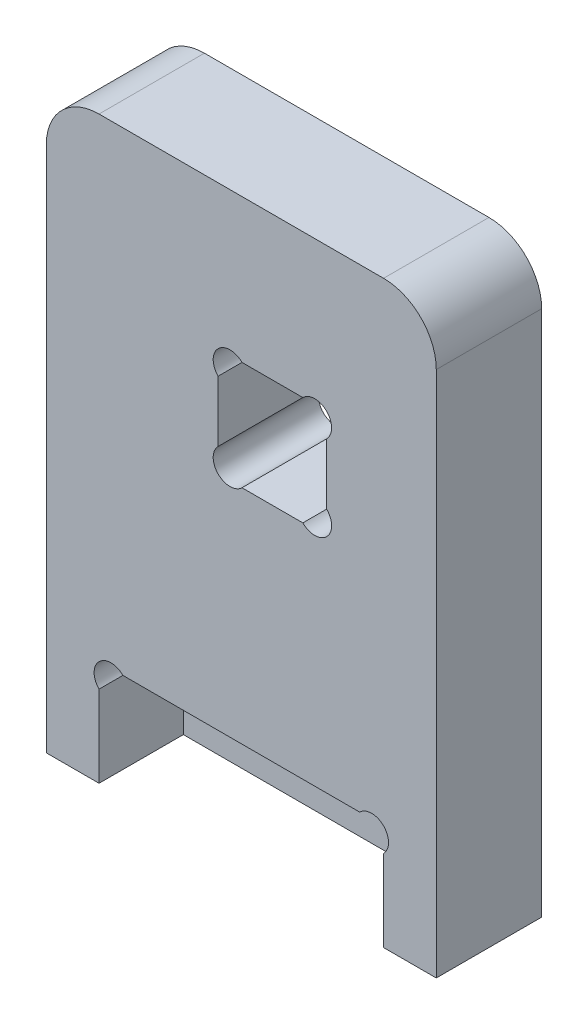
ISO-10303-21;
HEADER;
FILE_DESCRIPTION(('STEP AP214'),'2;1');
FILE_NAME('part.step','',(''),(''),'','','');
FILE_SCHEMA(('AUTOMOTIVE_DESIGN { 1 0 10303 214 1 1 1 1 }'));
ENDSEC;
DATA;
#1=APPLICATION_CONTEXT('core data for automotive mechanical design processes');
#2=APPLICATION_PROTOCOL_DEFINITION('international standard','automotive_design',2000,#1);
#3=PRODUCT_CONTEXT('',#1,'mechanical');
#4=PRODUCT('Part','Part','',(#3));
#5=PRODUCT_RELATED_PRODUCT_CATEGORY('part','',(#4));
#6=PRODUCT_DEFINITION_FORMATION('','',#4);
#7=PRODUCT_DEFINITION_CONTEXT('part definition',#1,'design');
#8=PRODUCT_DEFINITION('design','',#6,#7);
#9=PRODUCT_DEFINITION_SHAPE('','',#8);
#10=(LENGTH_UNIT() NAMED_UNIT(*) SI_UNIT(.MILLI.,.METRE.));
#11=(NAMED_UNIT(*) PLANE_ANGLE_UNIT() SI_UNIT($,.RADIAN.));
#12=(NAMED_UNIT(*) SI_UNIT($,.STERADIAN.) SOLID_ANGLE_UNIT());
#13=UNCERTAINTY_MEASURE_WITH_UNIT(LENGTH_MEASURE(1.E-05),#10,'distance_accuracy_value','');
#14=(GEOMETRIC_REPRESENTATION_CONTEXT(3) GLOBAL_UNCERTAINTY_ASSIGNED_CONTEXT((#13)) GLOBAL_UNIT_ASSIGNED_CONTEXT((#10,
#11,#12)) REPRESENTATION_CONTEXT('',''));
#15=CARTESIAN_POINT('',(0.,0.,0.));
#16=DIRECTION('',(0.,0.,1.));
#17=DIRECTION('',(1.,0.,0.));
#18=AXIS2_PLACEMENT_3D('',#15,#16,#17);
#19=CARTESIAN_POINT('',(0.,0.,10.));
#20=DIRECTION('',(0.,0.,1.));
#21=DIRECTION('',(1.,0.,0.));
#22=AXIS2_PLACEMENT_3D('',#19,#20,#21);
#23=PLANE('',#22);
#24=DIRECTION('',(-1.,0.,0.));
#25=VECTOR('',#24,1.);
#26=CARTESIAN_POINT('',(-18.5,24.21,10.));
#27=LINE('',#26,#25);
#28=CARTESIAN_POINT('',(13.5,24.21,10.));
#29=VERTEX_POINT('',#28);
#30=CARTESIAN_POINT('',(-13.5,24.21,10.));
#31=VERTEX_POINT('',#30);
#32=EDGE_CURVE('E288',#29,#31,#27,.T.);
#33=ORIENTED_EDGE('',*,*,#32,.T.);
#34=CARTESIAN_POINT('',(-13.5,19.21,10.));
#35=DIRECTION('',(0.,0.,1.));
#36=DIRECTION('',(1.,0.,0.));
#37=AXIS2_PLACEMENT_3D('',#34,#35,#36);
#38=CIRCLE('',#37,5.);
#39=CARTESIAN_POINT('',(-18.5,19.21,10.));
#40=VERTEX_POINT('',#39);
#41=EDGE_CURVE('E40',#31,#40,#38,.T.);
#42=ORIENTED_EDGE('',*,*,#41,.T.);
#43=DIRECTION('',(0.,-1.,0.));
#44=VECTOR('',#43,1.);
#45=CARTESIAN_POINT('',(-18.5,24.21,10.));
#46=LINE('',#45,#44);
#47=CARTESIAN_POINT('',(-18.5,-30.79,10.));
#48=VERTEX_POINT('',#47);
#49=EDGE_CURVE('E291',#40,#48,#46,.T.);
#50=ORIENTED_EDGE('',*,*,#49,.T.);
#51=DIRECTION('',(1.,0.,0.));
#52=VECTOR('',#51,1.);
#53=CARTESIAN_POINT('',(-18.5,-30.79,10.));
#54=LINE('',#53,#52);
#55=CARTESIAN_POINT('',(-13.5,-30.79,10.));
#56=VERTEX_POINT('',#55);
#57=EDGE_CURVE('E294',#48,#56,#54,.T.);
#58=ORIENTED_EDGE('',*,*,#57,.T.);
#59=DIRECTION('',(0.,-1.,0.));
#60=VECTOR('',#59,1.);
#61=CARTESIAN_POINT('',(-13.5,-23.052741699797,10.));
#62=LINE('',#61,#60);
#63=CARTESIAN_POINT('',(-13.5,-23.052741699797,10.));
#64=VERTEX_POINT('',#63);
#65=EDGE_CURVE('E210',#64,#56,#62,.T.);
#66=ORIENTED_EDGE('',*,*,#65,.F.);
#67=CARTESIAN_POINT('',(-12.3686291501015,-21.9213708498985,10.));
#68=DIRECTION('',(0.,0.,1.));
#69=DIRECTION('',(1.,0.,0.));
#70=AXIS2_PLACEMENT_3D('',#67,#68,#69);
#71=CIRCLE('',#70,1.6);
#72=CARTESIAN_POINT('',(-11.2372583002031,-20.79,10.));
#73=VERTEX_POINT('',#72);
#74=EDGE_CURVE('E178',#73,#64,#71,.T.);
#75=ORIENTED_EDGE('',*,*,#74,.F.);
#76=DIRECTION('',(-1.,0.,0.));
#77=VECTOR('',#76,1.);
#78=CARTESIAN_POINT('',(-11.2372583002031,-20.79,10.));
#79=LINE('',#78,#77);
#80=CARTESIAN_POINT('',(11.2372583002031,-20.79,10.));
#81=VERTEX_POINT('',#80);
#82=EDGE_CURVE('E196',#81,#73,#79,.T.);
#83=ORIENTED_EDGE('',*,*,#82,.F.);
#84=CARTESIAN_POINT('',(12.3686291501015,-21.9213708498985,10.));
#85=DIRECTION('',(0.,0.,1.));
#86=DIRECTION('',(-1.,0.,0.));
#87=AXIS2_PLACEMENT_3D('',#84,#85,#86);
#88=CIRCLE('',#87,1.6);
#89=CARTESIAN_POINT('',(13.5,-23.052741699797,10.));
#90=VERTEX_POINT('',#89);
#91=EDGE_CURVE('E199',#90,#81,#88,.T.);
#92=ORIENTED_EDGE('',*,*,#91,.F.);
#93=DIRECTION('',(0.,1.,0.));
#94=VECTOR('',#93,1.);
#95=CARTESIAN_POINT('',(13.5,-23.052741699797,10.));
#96=LINE('',#95,#94);
#97=CARTESIAN_POINT('',(13.5,-30.79,10.));
#98=VERTEX_POINT('',#97);
#99=EDGE_CURVE('E212',#98,#90,#96,.T.);
#100=ORIENTED_EDGE('',*,*,#99,.F.);
#101=CARTESIAN_POINT('',(18.5,-30.79,10.));
#102=VERTEX_POINT('',#101);
#103=EDGE_CURVE('E293',#98,#102,#54,.T.);
#104=ORIENTED_EDGE('',*,*,#103,.T.);
#105=DIRECTION('',(0.,1.,0.));
#106=VECTOR('',#105,1.);
#107=CARTESIAN_POINT('',(18.5,24.21,10.));
#108=LINE('',#107,#106);
#109=CARTESIAN_POINT('',(18.5,19.21,10.));
#110=VERTEX_POINT('',#109);
#111=EDGE_CURVE('E286',#102,#110,#108,.T.);
#112=ORIENTED_EDGE('',*,*,#111,.T.);
#113=CARTESIAN_POINT('',(13.5,19.21,10.));
#114=DIRECTION('',(0.,0.,1.));
#115=DIRECTION('',(1.,0.,0.));
#116=AXIS2_PLACEMENT_3D('',#113,#114,#115);
#117=CIRCLE('',#116,5.);
#118=EDGE_CURVE('E320',#110,#29,#117,.T.);
#119=ORIENTED_EDGE('',*,*,#118,.T.);
#120=EDGE_LOOP('',(#33,#42,#50,#58,#66,#75,#83,#92,#100,#104,#112,#119));
#121=FACE_BOUND('',#120,.T.);
#122=DIRECTION('',(0.,-1.,0.));
#123=VECTOR('',#122,1.);
#124=CARTESIAN_POINT('',(-2.20000000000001,8.31725830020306,10.));
#125=LINE('',#124,#123);
#126=CARTESIAN_POINT('',(-2.20000000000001,8.31725830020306,10.));
#127=VERTEX_POINT('',#126);
#128=CARTESIAN_POINT('',(-2.20000000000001,2.54274169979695,10.));
#129=VERTEX_POINT('',#128);
#130=EDGE_CURVE('E229',#127,#129,#125,.T.);
#131=ORIENTED_EDGE('',*,*,#130,.F.);
#132=CARTESIAN_POINT('',(-1.06862915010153,9.44862915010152,10.));
#133=DIRECTION('',(0.,0.,1.));
#134=DIRECTION('',(-1.,0.,0.));
#135=AXIS2_PLACEMENT_3D('',#132,#133,#134);
#136=CIRCLE('',#135,1.6);
#137=CARTESIAN_POINT('',(0.0627416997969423,10.58,10.));
#138=VERTEX_POINT('',#137);
#139=EDGE_CURVE('E227',#138,#127,#136,.T.);
#140=ORIENTED_EDGE('',*,*,#139,.F.);
#141=DIRECTION('',(-1.,0.,0.));
#142=VECTOR('',#141,1.);
#143=CARTESIAN_POINT('',(5.83725830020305,10.58,10.));
#144=LINE('',#143,#142);
#145=CARTESIAN_POINT('',(5.83725830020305,10.58,10.));
#146=VERTEX_POINT('',#145);
#147=EDGE_CURVE('E243',#146,#138,#144,.T.);
#148=ORIENTED_EDGE('',*,*,#147,.F.);
#149=CARTESIAN_POINT('',(6.96862915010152,9.44862915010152,10.));
#150=DIRECTION('',(0.,0.,1.));
#151=DIRECTION('',(1.,0.,0.));
#152=AXIS2_PLACEMENT_3D('',#149,#150,#151);
#153=CIRCLE('',#152,1.6);
#154=CARTESIAN_POINT('',(8.10000000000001,8.31725830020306,10.));
#155=VERTEX_POINT('',#154);
#156=EDGE_CURVE('E240',#155,#146,#153,.T.);
#157=ORIENTED_EDGE('',*,*,#156,.F.);
#158=DIRECTION('',(0.,1.,0.));
#159=VECTOR('',#158,1.);
#160=CARTESIAN_POINT('',(8.10000000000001,8.31725830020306,10.));
#161=LINE('',#160,#159);
#162=CARTESIAN_POINT('',(8.10000000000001,2.54274169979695,10.));
#163=VERTEX_POINT('',#162);
#164=EDGE_CURVE('E238',#163,#155,#161,.T.);
#165=ORIENTED_EDGE('',*,*,#164,.F.);
#166=CARTESIAN_POINT('',(6.96862915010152,1.41137084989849,10.));
#167=DIRECTION('',(0.,0.,1.));
#168=DIRECTION('',(-1.,0.,0.));
#169=AXIS2_PLACEMENT_3D('',#166,#167,#168);
#170=CIRCLE('',#169,1.6);
#171=CARTESIAN_POINT('',(5.83725830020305,0.280000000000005,10.));
#172=VERTEX_POINT('',#171);
#173=EDGE_CURVE('E236',#172,#163,#170,.T.);
#174=ORIENTED_EDGE('',*,*,#173,.F.);
#175=DIRECTION('',(1.,0.,0.));
#176=VECTOR('',#175,1.);
#177=CARTESIAN_POINT('',(5.83725830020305,0.280000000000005,10.));
#178=LINE('',#177,#176);
#179=CARTESIAN_POINT('',(0.0627416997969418,0.280000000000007,10.));
#180=VERTEX_POINT('',#179);
#181=EDGE_CURVE('E234',#180,#172,#178,.T.);
#182=ORIENTED_EDGE('',*,*,#181,.F.);
#183=CARTESIAN_POINT('',(-1.06862915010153,1.41137084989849,10.));
#184=DIRECTION('',(0.,0.,1.));
#185=DIRECTION('',(1.,0.,0.));
#186=AXIS2_PLACEMENT_3D('',#183,#184,#185);
#187=CIRCLE('',#186,1.6);
#188=EDGE_CURVE('E232',#129,#180,#187,.T.);
#189=ORIENTED_EDGE('',*,*,#188,.F.);
#190=EDGE_LOOP('',(#131,#140,#148,#157,#165,#174,#182,#189));
#191=FACE_BOUND('',#190,.T.);
#192=ADVANCED_FACE('F32',(#121,#191),#23,.T.);
#193=CARTESIAN_POINT('',(0.,0.,0.));
#194=DIRECTION('',(0.,0.,1.));
#195=DIRECTION('',(1.,0.,0.));
#196=AXIS2_PLACEMENT_3D('',#193,#194,#195);
#197=PLANE('',#196);
#198=DIRECTION('',(0.,-1.,0.));
#199=VECTOR('',#198,1.);
#200=CARTESIAN_POINT('',(-18.5,24.21,0.));
#201=LINE('',#200,#199);
#202=CARTESIAN_POINT('',(-18.5,19.21,0.));
#203=VERTEX_POINT('',#202);
#204=CARTESIAN_POINT('',(-18.5,-30.79,0.));
#205=VERTEX_POINT('',#204);
#206=EDGE_CURVE('E301',#203,#205,#201,.T.);
#207=ORIENTED_EDGE('',*,*,#206,.F.);
#208=CARTESIAN_POINT('',(-13.5,19.21,0.));
#209=DIRECTION('',(0.,0.,1.));
#210=DIRECTION('',(1.,0.,0.));
#211=AXIS2_PLACEMENT_3D('',#208,#209,#210);
#212=CIRCLE('',#211,5.);
#213=CARTESIAN_POINT('',(-13.5,24.21,0.));
#214=VERTEX_POINT('',#213);
#215=EDGE_CURVE('E314',#203,#214,#212,.F.);
#216=ORIENTED_EDGE('',*,*,#215,.T.);
#217=DIRECTION('',(-1.,0.,0.));
#218=VECTOR('',#217,1.);
#219=CARTESIAN_POINT('',(-18.5,24.21,0.));
#220=LINE('',#219,#218);
#221=CARTESIAN_POINT('',(13.5,24.21,0.));
#222=VERTEX_POINT('',#221);
#223=EDGE_CURVE('E299',#222,#214,#220,.T.);
#224=ORIENTED_EDGE('',*,*,#223,.F.);
#225=CARTESIAN_POINT('',(13.5,19.21,0.));
#226=DIRECTION('',(0.,0.,1.));
#227=DIRECTION('',(1.,0.,0.));
#228=AXIS2_PLACEMENT_3D('',#225,#226,#227);
#229=CIRCLE('',#228,5.);
#230=CARTESIAN_POINT('',(18.5,19.21,0.));
#231=VERTEX_POINT('',#230);
#232=EDGE_CURVE('E312',#222,#231,#229,.F.);
#233=ORIENTED_EDGE('',*,*,#232,.T.);
#234=DIRECTION('',(0.,1.,0.));
#235=VECTOR('',#234,1.);
#236=CARTESIAN_POINT('',(18.5,24.21,0.));
#237=LINE('',#236,#235);
#238=CARTESIAN_POINT('',(18.5,-30.79,0.));
#239=VERTEX_POINT('',#238);
#240=EDGE_CURVE('E285',#239,#231,#237,.T.);
#241=ORIENTED_EDGE('',*,*,#240,.F.);
#242=DIRECTION('',(1.,0.,0.));
#243=VECTOR('',#242,1.);
#244=CARTESIAN_POINT('',(-18.5,-30.79,0.));
#245=LINE('',#244,#243);
#246=EDGE_CURVE('E289',#205,#239,#245,.T.);
#247=ORIENTED_EDGE('',*,*,#246,.F.);
#248=EDGE_LOOP('',(#207,#216,#224,#233,#241,#247));
#249=FACE_BOUND('',#248,.T.);
#250=CARTESIAN_POINT('',(-1.06862915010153,9.44862915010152,0.));
#251=DIRECTION('',(0.,0.,1.));
#252=DIRECTION('',(-1.,0.,0.));
#253=AXIS2_PLACEMENT_3D('',#250,#251,#252);
#254=CIRCLE('',#253,1.6);
#255=CARTESIAN_POINT('',(0.0627416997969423,10.58,0.));
#256=VERTEX_POINT('',#255);
#257=CARTESIAN_POINT('',(-2.20000000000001,8.31725830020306,0.));
#258=VERTEX_POINT('',#257);
#259=EDGE_CURVE('E219',#256,#258,#254,.T.);
#260=ORIENTED_EDGE('',*,*,#259,.T.);
#261=DIRECTION('',(0.,-1.,0.));
#262=VECTOR('',#261,1.);
#263=CARTESIAN_POINT('',(-2.20000000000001,8.31725830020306,0.));
#264=LINE('',#263,#262);
#265=CARTESIAN_POINT('',(-2.20000000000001,2.54274169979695,0.));
#266=VERTEX_POINT('',#265);
#267=EDGE_CURVE('E248',#258,#266,#264,.T.);
#268=ORIENTED_EDGE('',*,*,#267,.T.);
#269=CARTESIAN_POINT('',(-1.06862915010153,1.41137084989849,0.));
#270=DIRECTION('',(0.,0.,1.));
#271=DIRECTION('',(1.,0.,0.));
#272=AXIS2_PLACEMENT_3D('',#269,#270,#271);
#273=CIRCLE('',#272,1.6);
#274=CARTESIAN_POINT('',(0.0627416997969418,0.280000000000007,0.));
#275=VERTEX_POINT('',#274);
#276=EDGE_CURVE('E251',#266,#275,#273,.T.);
#277=ORIENTED_EDGE('',*,*,#276,.T.);
#278=DIRECTION('',(1.,0.,0.));
#279=VECTOR('',#278,1.);
#280=CARTESIAN_POINT('',(5.83725830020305,0.280000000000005,0.));
#281=LINE('',#280,#279);
#282=CARTESIAN_POINT('',(5.83725830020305,0.280000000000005,0.));
#283=VERTEX_POINT('',#282);
#284=EDGE_CURVE('E254',#275,#283,#281,.T.);
#285=ORIENTED_EDGE('',*,*,#284,.T.);
#286=CARTESIAN_POINT('',(6.96862915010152,1.41137084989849,0.));
#287=DIRECTION('',(0.,0.,1.));
#288=DIRECTION('',(-1.,0.,0.));
#289=AXIS2_PLACEMENT_3D('',#286,#287,#288);
#290=CIRCLE('',#289,1.6);
#291=CARTESIAN_POINT('',(8.10000000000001,2.54274169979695,0.));
#292=VERTEX_POINT('',#291);
#293=EDGE_CURVE('E257',#283,#292,#290,.T.);
#294=ORIENTED_EDGE('',*,*,#293,.T.);
#295=DIRECTION('',(0.,1.,0.));
#296=VECTOR('',#295,1.);
#297=CARTESIAN_POINT('',(8.10000000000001,8.31725830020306,0.));
#298=LINE('',#297,#296);
#299=CARTESIAN_POINT('',(8.10000000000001,8.31725830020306,0.));
#300=VERTEX_POINT('',#299);
#301=EDGE_CURVE('E260',#292,#300,#298,.T.);
#302=ORIENTED_EDGE('',*,*,#301,.T.);
#303=CARTESIAN_POINT('',(6.96862915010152,9.44862915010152,0.));
#304=DIRECTION('',(0.,0.,1.));
#305=DIRECTION('',(1.,0.,0.));
#306=AXIS2_PLACEMENT_3D('',#303,#304,#305);
#307=CIRCLE('',#306,1.6);
#308=CARTESIAN_POINT('',(5.83725830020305,10.58,0.));
#309=VERTEX_POINT('',#308);
#310=EDGE_CURVE('E263',#300,#309,#307,.T.);
#311=ORIENTED_EDGE('',*,*,#310,.T.);
#312=DIRECTION('',(-1.,0.,0.));
#313=VECTOR('',#312,1.);
#314=CARTESIAN_POINT('',(5.83725830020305,10.58,0.));
#315=LINE('',#314,#313);
#316=EDGE_CURVE('E230',#309,#256,#315,.T.);
#317=ORIENTED_EDGE('',*,*,#316,.T.);
#318=EDGE_LOOP('',(#260,#268,#277,#285,#294,#302,#311,#317));
#319=FACE_BOUND('',#318,.T.);
#320=ADVANCED_FACE('F335',(#249,#319),#197,.F.);
#321=CARTESIAN_POINT('',(18.5,24.21,10.));
#322=DIRECTION('',(-1.,0.,0.));
#323=DIRECTION('',(0.,0.,1.));
#324=AXIS2_PLACEMENT_3D('',#321,#322,#323);
#325=PLANE('',#324);
#326=ORIENTED_EDGE('',*,*,#240,.T.);
#327=DIRECTION('',(0.,0.,-1.));
#328=VECTOR('',#327,1.);
#329=CARTESIAN_POINT('',(18.5,19.21,10.));
#330=LINE('',#329,#328);
#331=EDGE_CURVE('E11',#231,#110,#330,.F.);
#332=ORIENTED_EDGE('',*,*,#331,.T.);
#333=ORIENTED_EDGE('',*,*,#111,.F.);
#334=DIRECTION('',(0.,0.,-1.));
#335=VECTOR('',#334,1.);
#336=CARTESIAN_POINT('',(18.5,-30.79,10.));
#337=LINE('',#336,#335);
#338=EDGE_CURVE('E297',#102,#239,#337,.T.);
#339=ORIENTED_EDGE('',*,*,#338,.T.);
#340=EDGE_LOOP('',(#326,#332,#333,#339));
#341=FACE_BOUND('',#340,.T.);
#342=ADVANCED_FACE('F343',(#341),#325,.F.);
#343=CARTESIAN_POINT('',(-18.5,24.21,10.));
#344=DIRECTION('',(0.,-1.,0.));
#345=DIRECTION('',(1.,0.,0.));
#346=AXIS2_PLACEMENT_3D('',#343,#344,#345);
#347=PLANE('',#346);
#348=ORIENTED_EDGE('',*,*,#223,.T.);
#349=DIRECTION('',(0.,0.,-1.));
#350=VECTOR('',#349,1.);
#351=CARTESIAN_POINT('',(-13.5,24.21,10.));
#352=LINE('',#351,#350);
#353=EDGE_CURVE('E53',#214,#31,#352,.F.);
#354=ORIENTED_EDGE('',*,*,#353,.T.);
#355=ORIENTED_EDGE('',*,*,#32,.F.);
#356=DIRECTION('',(0.,0.,-1.));
#357=VECTOR('',#356,1.);
#358=CARTESIAN_POINT('',(13.5,24.21,10.));
#359=LINE('',#358,#357);
#360=EDGE_CURVE('E316',#29,#222,#359,.T.);
#361=ORIENTED_EDGE('',*,*,#360,.T.);
#362=EDGE_LOOP('',(#348,#354,#355,#361));
#363=FACE_BOUND('',#362,.T.);
#364=ADVANCED_FACE('F338',(#363),#347,.F.);
#365=CARTESIAN_POINT('',(-18.5,24.21,10.));
#366=DIRECTION('',(1.,0.,0.));
#367=DIRECTION('',(0.,0.,-1.));
#368=AXIS2_PLACEMENT_3D('',#365,#366,#367);
#369=PLANE('',#368);
#370=ORIENTED_EDGE('',*,*,#49,.F.);
#371=DIRECTION('',(0.,0.,-1.));
#372=VECTOR('',#371,1.);
#373=CARTESIAN_POINT('',(-18.5,19.21,10.));
#374=LINE('',#373,#372);
#375=EDGE_CURVE('E309',#40,#203,#374,.T.);
#376=ORIENTED_EDGE('',*,*,#375,.T.);
#377=ORIENTED_EDGE('',*,*,#206,.T.);
#378=DIRECTION('',(0.,0.,-1.));
#379=VECTOR('',#378,1.);
#380=CARTESIAN_POINT('',(-18.5,-30.79,10.));
#381=LINE('',#380,#379);
#382=EDGE_CURVE('E306',#48,#205,#381,.T.);
#383=ORIENTED_EDGE('',*,*,#382,.F.);
#384=EDGE_LOOP('',(#370,#376,#377,#383));
#385=FACE_BOUND('',#384,.T.);
#386=ADVANCED_FACE('F329',(#385),#369,.F.);
#387=CARTESIAN_POINT('',(-18.5,-30.79,10.));
#388=DIRECTION('',(0.,1.,0.));
#389=DIRECTION('',(-1.,0.,0.));
#390=AXIS2_PLACEMENT_3D('',#387,#388,#389);
#391=PLANE('',#390);
#392=ORIENTED_EDGE('',*,*,#103,.F.);
#393=DIRECTION('',(0.,0.,1.));
#394=VECTOR('',#393,1.);
#395=CARTESIAN_POINT('',(13.5,-30.79,2.));
#396=LINE('',#395,#394);
#397=CARTESIAN_POINT('',(13.5,-30.79,2.));
#398=VERTEX_POINT('',#397);
#399=EDGE_CURVE('E224',#398,#98,#396,.T.);
#400=ORIENTED_EDGE('',*,*,#399,.F.);
#401=DIRECTION('',(1.,0.,0.));
#402=VECTOR('',#401,1.);
#403=CARTESIAN_POINT('',(-13.5,-30.79,2.));
#404=LINE('',#403,#402);
#405=CARTESIAN_POINT('',(-13.5,-30.79,2.));
#406=VERTEX_POINT('',#405);
#407=EDGE_CURVE('E191',#406,#398,#404,.T.);
#408=ORIENTED_EDGE('',*,*,#407,.F.);
#409=DIRECTION('',(0.,0.,1.));
#410=VECTOR('',#409,1.);
#411=CARTESIAN_POINT('',(-13.5,-30.79,2.));
#412=LINE('',#411,#410);
#413=EDGE_CURVE('E181',#406,#56,#412,.T.);
#414=ORIENTED_EDGE('',*,*,#413,.T.);
#415=ORIENTED_EDGE('',*,*,#57,.F.);
#416=ORIENTED_EDGE('',*,*,#382,.T.);
#417=ORIENTED_EDGE('',*,*,#246,.T.);
#418=ORIENTED_EDGE('',*,*,#338,.F.);
#419=EDGE_LOOP('',(#392,#400,#408,#414,#415,#416,#417,#418));
#420=FACE_BOUND('',#419,.T.);
#421=ADVANCED_FACE('F347',(#420),#391,.F.);
#422=CARTESIAN_POINT('',(-1.06862915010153,9.44862915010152,10.));
#423=DIRECTION('',(0.,0.,-1.));
#424=DIRECTION('',(-1.,0.,0.));
#425=AXIS2_PLACEMENT_3D('',#422,#423,#424);
#426=CYLINDRICAL_SURFACE('',#425,1.6);
#427=ORIENTED_EDGE('',*,*,#259,.F.);
#428=DIRECTION('',(0.,0.,-1.));
#429=VECTOR('',#428,1.);
#430=CARTESIAN_POINT('',(0.0627416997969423,10.58,10.));
#431=LINE('',#430,#429);
#432=EDGE_CURVE('E245',#138,#256,#431,.T.);
#433=ORIENTED_EDGE('',*,*,#432,.F.);
#434=ORIENTED_EDGE('',*,*,#139,.T.);
#435=DIRECTION('',(0.,0.,-1.));
#436=VECTOR('',#435,1.);
#437=CARTESIAN_POINT('',(-2.20000000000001,8.31725830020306,10.));
#438=LINE('',#437,#436);
#439=EDGE_CURVE('E282',#127,#258,#438,.T.);
#440=ORIENTED_EDGE('',*,*,#439,.T.);
#441=EDGE_LOOP('',(#427,#433,#434,#440));
#442=FACE_BOUND('',#441,.T.);
#443=ADVANCED_FACE('F374',(#442),#426,.F.);
#444=CARTESIAN_POINT('',(-2.20000000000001,8.31725830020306,10.));
#445=DIRECTION('',(1.,0.,0.));
#446=DIRECTION('',(0.,1.,0.));
#447=AXIS2_PLACEMENT_3D('',#444,#445,#446);
#448=PLANE('',#447);
#449=ORIENTED_EDGE('',*,*,#267,.F.);
#450=ORIENTED_EDGE('',*,*,#439,.F.);
#451=ORIENTED_EDGE('',*,*,#130,.T.);
#452=DIRECTION('',(0.,0.,-1.));
#453=VECTOR('',#452,1.);
#454=CARTESIAN_POINT('',(-2.20000000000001,2.54274169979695,10.));
#455=LINE('',#454,#453);
#456=EDGE_CURVE('E280',#129,#266,#455,.T.);
#457=ORIENTED_EDGE('',*,*,#456,.T.);
#458=EDGE_LOOP('',(#449,#450,#451,#457));
#459=FACE_BOUND('',#458,.T.);
#460=ADVANCED_FACE('F423',(#459),#448,.T.);
#461=CARTESIAN_POINT('',(-1.06862915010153,1.41137084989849,10.));
#462=DIRECTION('',(0.,0.,-1.));
#463=DIRECTION('',(-1.,0.,0.));
#464=AXIS2_PLACEMENT_3D('',#461,#462,#463);
#465=CYLINDRICAL_SURFACE('',#464,1.6);
#466=ORIENTED_EDGE('',*,*,#276,.F.);
#467=ORIENTED_EDGE('',*,*,#456,.F.);
#468=ORIENTED_EDGE('',*,*,#188,.T.);
#469=DIRECTION('',(0.,0.,-1.));
#470=VECTOR('',#469,1.);
#471=CARTESIAN_POINT('',(0.0627416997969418,0.280000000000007,10.));
#472=LINE('',#471,#470);
#473=EDGE_CURVE('E278',#180,#275,#472,.T.);
#474=ORIENTED_EDGE('',*,*,#473,.T.);
#475=EDGE_LOOP('',(#466,#467,#468,#474));
#476=FACE_BOUND('',#475,.T.);
#477=ADVANCED_FACE('F420',(#476),#465,.F.);
#478=CARTESIAN_POINT('',(5.83725830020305,0.280000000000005,10.));
#479=DIRECTION('',(0.,1.,0.));
#480=DIRECTION('',(0.,0.,1.));
#481=AXIS2_PLACEMENT_3D('',#478,#479,#480);
#482=PLANE('',#481);
#483=ORIENTED_EDGE('',*,*,#284,.F.);
#484=ORIENTED_EDGE('',*,*,#473,.F.);
#485=ORIENTED_EDGE('',*,*,#181,.T.);
#486=DIRECTION('',(0.,0.,-1.));
#487=VECTOR('',#486,1.);
#488=CARTESIAN_POINT('',(5.83725830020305,0.280000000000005,10.));
#489=LINE('',#488,#487);
#490=EDGE_CURVE('E276',#172,#283,#489,.T.);
#491=ORIENTED_EDGE('',*,*,#490,.T.);
#492=EDGE_LOOP('',(#483,#484,#485,#491));
#493=FACE_BOUND('',#492,.T.);
#494=ADVANCED_FACE('F416',(#493),#482,.T.);
#495=CARTESIAN_POINT('',(6.96862915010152,1.41137084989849,10.));
#496=DIRECTION('',(0.,0.,-1.));
#497=DIRECTION('',(-1.,0.,0.));
#498=AXIS2_PLACEMENT_3D('',#495,#496,#497);
#499=CYLINDRICAL_SURFACE('',#498,1.6);
#500=ORIENTED_EDGE('',*,*,#293,.F.);
#501=ORIENTED_EDGE('',*,*,#490,.F.);
#502=ORIENTED_EDGE('',*,*,#173,.T.);
#503=DIRECTION('',(0.,0.,-1.));
#504=VECTOR('',#503,1.);
#505=CARTESIAN_POINT('',(8.10000000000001,2.54274169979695,10.));
#506=LINE('',#505,#504);
#507=EDGE_CURVE('E274',#163,#292,#506,.T.);
#508=ORIENTED_EDGE('',*,*,#507,.T.);
#509=EDGE_LOOP('',(#500,#501,#502,#508));
#510=FACE_BOUND('',#509,.T.);
#511=ADVANCED_FACE('F412',(#510),#499,.F.);
#512=CARTESIAN_POINT('',(8.10000000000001,8.31725830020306,10.));
#513=DIRECTION('',(-1.,0.,0.));
#514=DIRECTION('',(0.,-1.,0.));
#515=AXIS2_PLACEMENT_3D('',#512,#513,#514);
#516=PLANE('',#515);
#517=ORIENTED_EDGE('',*,*,#301,.F.);
#518=ORIENTED_EDGE('',*,*,#507,.F.);
#519=ORIENTED_EDGE('',*,*,#164,.T.);
#520=DIRECTION('',(0.,0.,-1.));
#521=VECTOR('',#520,1.);
#522=CARTESIAN_POINT('',(8.10000000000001,8.31725830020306,10.));
#523=LINE('',#522,#521);
#524=EDGE_CURVE('E272',#155,#300,#523,.T.);
#525=ORIENTED_EDGE('',*,*,#524,.T.);
#526=EDGE_LOOP('',(#517,#518,#519,#525));
#527=FACE_BOUND('',#526,.T.);
#528=ADVANCED_FACE('F408',(#527),#516,.T.);
#529=CARTESIAN_POINT('',(6.96862915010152,9.44862915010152,10.));
#530=DIRECTION('',(0.,0.,-1.));
#531=DIRECTION('',(-1.,0.,0.));
#532=AXIS2_PLACEMENT_3D('',#529,#530,#531);
#533=CYLINDRICAL_SURFACE('',#532,1.6);
#534=ORIENTED_EDGE('',*,*,#310,.F.);
#535=ORIENTED_EDGE('',*,*,#524,.F.);
#536=ORIENTED_EDGE('',*,*,#156,.T.);
#537=DIRECTION('',(0.,0.,-1.));
#538=VECTOR('',#537,1.);
#539=CARTESIAN_POINT('',(5.83725830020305,10.58,10.));
#540=LINE('',#539,#538);
#541=EDGE_CURVE('E270',#146,#309,#540,.T.);
#542=ORIENTED_EDGE('',*,*,#541,.T.);
#543=EDGE_LOOP('',(#534,#535,#536,#542));
#544=FACE_BOUND('',#543,.T.);
#545=ADVANCED_FACE('F402',(#544),#533,.F.);
#546=CARTESIAN_POINT('',(5.83725830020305,10.58,10.));
#547=DIRECTION('',(0.,-1.,0.));
#548=DIRECTION('',(0.,0.,-1.));
#549=AXIS2_PLACEMENT_3D('',#546,#547,#548);
#550=PLANE('',#549);
#551=ORIENTED_EDGE('',*,*,#316,.F.);
#552=ORIENTED_EDGE('',*,*,#541,.F.);
#553=ORIENTED_EDGE('',*,*,#147,.T.);
#554=ORIENTED_EDGE('',*,*,#432,.T.);
#555=EDGE_LOOP('',(#551,#552,#553,#554));
#556=FACE_BOUND('',#555,.T.);
#557=ADVANCED_FACE('F397',(#556),#550,.T.);
#558=CARTESIAN_POINT('',(-12.3686291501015,-21.9213708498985,2.));
#559=DIRECTION('',(0.,0.,1.));
#560=DIRECTION('',(1.,0.,0.));
#561=AXIS2_PLACEMENT_3D('',#558,#559,#560);
#562=CYLINDRICAL_SURFACE('',#561,1.6);
#563=ORIENTED_EDGE('',*,*,#74,.T.);
#564=DIRECTION('',(0.,0.,1.));
#565=VECTOR('',#564,1.);
#566=CARTESIAN_POINT('',(-13.5,-23.052741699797,2.));
#567=LINE('',#566,#565);
#568=CARTESIAN_POINT('',(-13.5,-23.052741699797,2.));
#569=VERTEX_POINT('',#568);
#570=EDGE_CURVE('E171',#569,#64,#567,.T.);
#571=ORIENTED_EDGE('',*,*,#570,.F.);
#572=CARTESIAN_POINT('',(-12.3686291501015,-21.9213708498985,2.));
#573=DIRECTION('',(0.,0.,1.));
#574=DIRECTION('',(1.,0.,0.));
#575=AXIS2_PLACEMENT_3D('',#572,#573,#574);
#576=CIRCLE('',#575,1.6);
#577=CARTESIAN_POINT('',(-11.2372583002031,-20.79,2.));
#578=VERTEX_POINT('',#577);
#579=EDGE_CURVE('E175',#578,#569,#576,.T.);
#580=ORIENTED_EDGE('',*,*,#579,.F.);
#581=DIRECTION('',(0.,0.,1.));
#582=VECTOR('',#581,1.);
#583=CARTESIAN_POINT('',(-11.2372583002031,-20.79,2.));
#584=LINE('',#583,#582);
#585=EDGE_CURVE('E217',#578,#73,#584,.T.);
#586=ORIENTED_EDGE('',*,*,#585,.T.);
#587=EDGE_LOOP('',(#563,#571,#580,#586));
#588=FACE_BOUND('',#587,.T.);
#589=ADVANCED_FACE('F173',(#588),#562,.F.);
#590=CARTESIAN_POINT('',(-11.2372583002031,-20.79,2.));
#591=DIRECTION('',(0.,1.,0.));
#592=DIRECTION('',(0.,0.,1.));
#593=AXIS2_PLACEMENT_3D('',#590,#591,#592);
#594=PLANE('',#593);
#595=ORIENTED_EDGE('',*,*,#82,.T.);
#596=ORIENTED_EDGE('',*,*,#585,.F.);
#597=DIRECTION('',(-1.,0.,0.));
#598=VECTOR('',#597,1.);
#599=CARTESIAN_POINT('',(-11.2372583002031,-20.79,2.));
#600=LINE('',#599,#598);
#601=CARTESIAN_POINT('',(11.2372583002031,-20.79,2.));
#602=VERTEX_POINT('',#601);
#603=EDGE_CURVE('E182',#602,#578,#600,.T.);
#604=ORIENTED_EDGE('',*,*,#603,.F.);
#605=DIRECTION('',(0.,0.,1.));
#606=VECTOR('',#605,1.);
#607=CARTESIAN_POINT('',(11.2372583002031,-20.79,2.));
#608=LINE('',#607,#606);
#609=EDGE_CURVE('E220',#602,#81,#608,.T.);
#610=ORIENTED_EDGE('',*,*,#609,.T.);
#611=EDGE_LOOP('',(#595,#596,#604,#610));
#612=FACE_BOUND('',#611,.T.);
#613=ADVANCED_FACE('F353',(#612),#594,.F.);
#614=CARTESIAN_POINT('',(12.3686291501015,-21.9213708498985,2.));
#615=DIRECTION('',(0.,0.,1.));
#616=DIRECTION('',(1.,0.,0.));
#617=AXIS2_PLACEMENT_3D('',#614,#615,#616);
#618=CYLINDRICAL_SURFACE('',#617,1.6);
#619=ORIENTED_EDGE('',*,*,#91,.T.);
#620=ORIENTED_EDGE('',*,*,#609,.F.);
#621=CARTESIAN_POINT('',(12.3686291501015,-21.9213708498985,2.));
#622=DIRECTION('',(0.,0.,1.));
#623=DIRECTION('',(-1.,0.,0.));
#624=AXIS2_PLACEMENT_3D('',#621,#622,#623);
#625=CIRCLE('',#624,1.6);
#626=CARTESIAN_POINT('',(13.5,-23.052741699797,2.));
#627=VERTEX_POINT('',#626);
#628=EDGE_CURVE('E206',#627,#602,#625,.T.);
#629=ORIENTED_EDGE('',*,*,#628,.F.);
#630=DIRECTION('',(0.,0.,1.));
#631=VECTOR('',#630,1.);
#632=CARTESIAN_POINT('',(13.5,-23.052741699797,2.));
#633=LINE('',#632,#631);
#634=EDGE_CURVE('E222',#627,#90,#633,.T.);
#635=ORIENTED_EDGE('',*,*,#634,.T.);
#636=EDGE_LOOP('',(#619,#620,#629,#635));
#637=FACE_BOUND('',#636,.T.);
#638=ADVANCED_FACE('F356',(#637),#618,.F.);
#639=CARTESIAN_POINT('',(13.5,-23.052741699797,2.));
#640=DIRECTION('',(1.,0.,0.));
#641=DIRECTION('',(0.,0.,-1.));
#642=AXIS2_PLACEMENT_3D('',#639,#640,#641);
#643=PLANE('',#642);
#644=ORIENTED_EDGE('',*,*,#99,.T.);
#645=ORIENTED_EDGE('',*,*,#634,.F.);
#646=DIRECTION('',(0.,1.,0.));
#647=VECTOR('',#646,1.);
#648=CARTESIAN_POINT('',(13.5,-23.052741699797,2.));
#649=LINE('',#648,#647);
#650=EDGE_CURVE('E203',#398,#627,#649,.T.);
#651=ORIENTED_EDGE('',*,*,#650,.F.);
#652=ORIENTED_EDGE('',*,*,#399,.T.);
#653=EDGE_LOOP('',(#644,#645,#651,#652));
#654=FACE_BOUND('',#653,.T.);
#655=ADVANCED_FACE('F358',(#654),#643,.F.);
#656=CARTESIAN_POINT('',(-13.5,-23.052741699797,2.));
#657=DIRECTION('',(-1.,0.,0.));
#658=DIRECTION('',(0.,0.,1.));
#659=AXIS2_PLACEMENT_3D('',#656,#657,#658);
#660=PLANE('',#659);
#661=ORIENTED_EDGE('',*,*,#65,.T.);
#662=ORIENTED_EDGE('',*,*,#413,.F.);
#663=DIRECTION('',(0.,-1.,0.));
#664=VECTOR('',#663,1.);
#665=CARTESIAN_POINT('',(-13.5,-23.052741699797,2.));
#666=LINE('',#665,#664);
#667=EDGE_CURVE('E185',#569,#406,#666,.T.);
#668=ORIENTED_EDGE('',*,*,#667,.F.);
#669=ORIENTED_EDGE('',*,*,#570,.T.);
#670=EDGE_LOOP('',(#661,#662,#668,#669));
#671=FACE_BOUND('',#670,.T.);
#672=ADVANCED_FACE('F186',(#671),#660,.F.);
#673=CARTESIAN_POINT('',(-12.3686291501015,-21.9213708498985,2.));
#674=DIRECTION('',(0.,0.,1.));
#675=DIRECTION('',(1.,0.,0.));
#676=AXIS2_PLACEMENT_3D('',#673,#674,#675);
#677=PLANE('',#676);
#678=ORIENTED_EDGE('',*,*,#579,.T.);
#679=ORIENTED_EDGE('',*,*,#667,.T.);
#680=ORIENTED_EDGE('',*,*,#407,.T.);
#681=ORIENTED_EDGE('',*,*,#650,.T.);
#682=ORIENTED_EDGE('',*,*,#628,.T.);
#683=ORIENTED_EDGE('',*,*,#603,.T.);
#684=EDGE_LOOP('',(#678,#679,#680,#681,#682,#683));
#685=FACE_BOUND('',#684,.T.);
#686=ADVANCED_FACE('F193',(#685),#677,.T.);
#687=CARTESIAN_POINT('',(-13.5,19.21,10.));
#688=DIRECTION('',(0.,0.,-1.));
#689=DIRECTION('',(-1.,0.,0.));
#690=AXIS2_PLACEMENT_3D('',#687,#688,#689);
#691=CYLINDRICAL_SURFACE('',#690,5.);
#692=ORIENTED_EDGE('',*,*,#41,.F.);
#693=ORIENTED_EDGE('',*,*,#353,.F.);
#694=ORIENTED_EDGE('',*,*,#215,.F.);
#695=ORIENTED_EDGE('',*,*,#375,.F.);
#696=EDGE_LOOP('',(#692,#693,#694,#695));
#697=FACE_BOUND('',#696,.T.);
#698=ADVANCED_FACE('F332',(#697),#691,.T.);
#699=CARTESIAN_POINT('',(13.5,19.21,10.));
#700=DIRECTION('',(0.,0.,-1.));
#701=DIRECTION('',(-1.,0.,0.));
#702=AXIS2_PLACEMENT_3D('',#699,#700,#701);
#703=CYLINDRICAL_SURFACE('',#702,5.);
#704=ORIENTED_EDGE('',*,*,#118,.F.);
#705=ORIENTED_EDGE('',*,*,#331,.F.);
#706=ORIENTED_EDGE('',*,*,#232,.F.);
#707=ORIENTED_EDGE('',*,*,#360,.F.);
#708=EDGE_LOOP('',(#704,#705,#706,#707));
#709=FACE_BOUND('',#708,.T.);
#710=ADVANCED_FACE('F34',(#709),#703,.T.);
#711=CLOSED_SHELL('',(#192,#320,#342,#364,#386,#421,#443,#460,#477,#494,#511,#528,#545,#557,
#589,#613,#638,#655,#672,#686,#698,#710));
#712=MANIFOLD_SOLID_BREP('B2',#711);
#713=ADVANCED_BREP_SHAPE_REPRESENTATION('',(#18,#712),#14);
#714=SHAPE_DEFINITION_REPRESENTATION(#9,#713);
ENDSEC;
END-ISO-10303-21;
